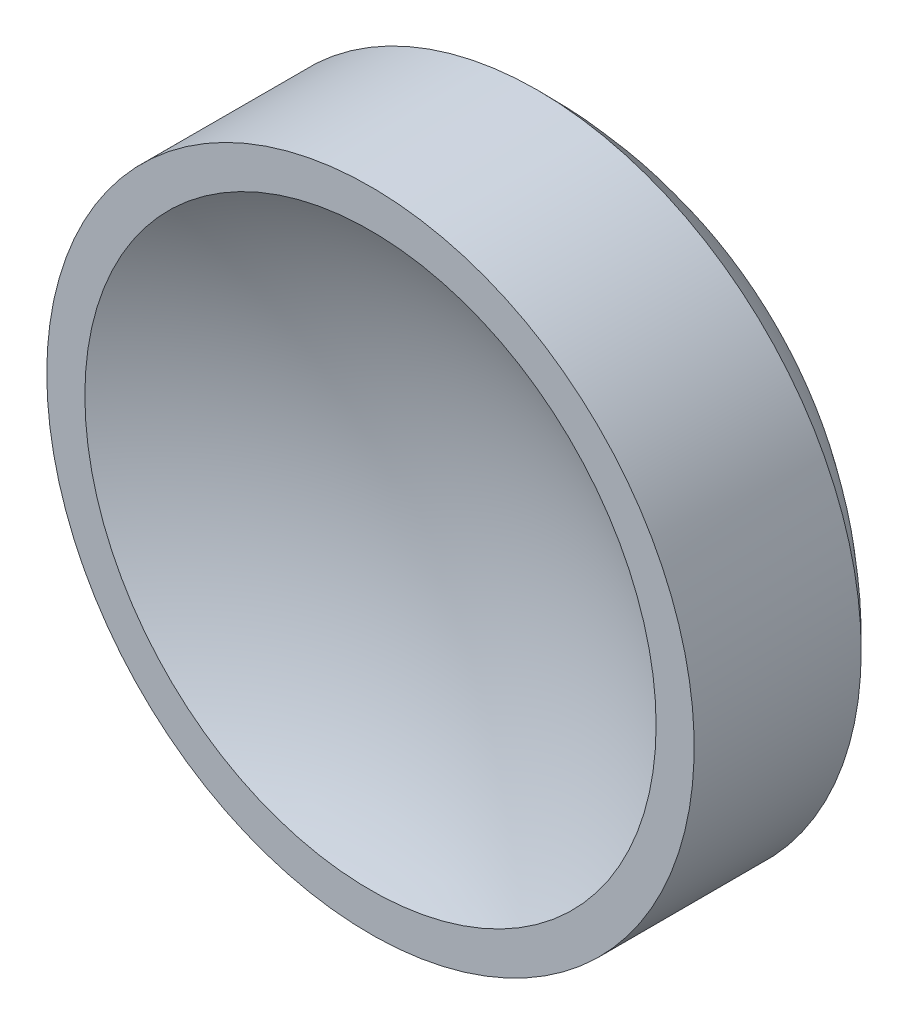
ISO-10303-21;
HEADER;
FILE_DESCRIPTION(('STEP AP214'),'2;1');
FILE_NAME('part.step','',(''),(''),'','','');
FILE_SCHEMA(('AUTOMOTIVE_DESIGN { 1 0 10303 214 1 1 1 1 }'));
ENDSEC;
DATA;
#1=APPLICATION_CONTEXT('core data for automotive mechanical design processes');
#2=APPLICATION_PROTOCOL_DEFINITION('international standard','automotive_design',2000,#1);
#3=PRODUCT_CONTEXT('',#1,'mechanical');
#4=PRODUCT('Part','Part','',(#3));
#5=PRODUCT_RELATED_PRODUCT_CATEGORY('part','',(#4));
#6=PRODUCT_DEFINITION_FORMATION('','',#4);
#7=PRODUCT_DEFINITION_CONTEXT('part definition',#1,'design');
#8=PRODUCT_DEFINITION('design','',#6,#7);
#9=PRODUCT_DEFINITION_SHAPE('','',#8);
#10=(LENGTH_UNIT() NAMED_UNIT(*) SI_UNIT(.MILLI.,.METRE.));
#11=(NAMED_UNIT(*) PLANE_ANGLE_UNIT() SI_UNIT($,.RADIAN.));
#12=(NAMED_UNIT(*) SI_UNIT($,.STERADIAN.) SOLID_ANGLE_UNIT());
#13=UNCERTAINTY_MEASURE_WITH_UNIT(LENGTH_MEASURE(1.E-05),#10,'distance_accuracy_value','');
#14=(GEOMETRIC_REPRESENTATION_CONTEXT(3) GLOBAL_UNCERTAINTY_ASSIGNED_CONTEXT((#13)) GLOBAL_UNIT_ASSIGNED_CONTEXT((#10,
#11,#12)) REPRESENTATION_CONTEXT('',''));
#15=CARTESIAN_POINT('',(0.,0.,0.));
#16=DIRECTION('',(0.,0.,1.));
#17=DIRECTION('',(1.,0.,0.));
#18=AXIS2_PLACEMENT_3D('',#15,#16,#17);
#19=CARTESIAN_POINT('',(0.,0.,5.1745));
#20=DIRECTION('',(0.,0.,-1.));
#21=DIRECTION('',(-1.,0.,0.));
#22=AXIS2_PLACEMENT_3D('',#19,#20,#21);
#23=CYLINDRICAL_SURFACE('',#22,8.5);
#24=CARTESIAN_POINT('',(0.,0.,0.490745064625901));
#25=DIRECTION('',(0.,0.,-1.));
#26=DIRECTION('',(-1.,0.,0.));
#27=AXIS2_PLACEMENT_3D('',#24,#25,#26);
#28=CIRCLE('',#27,8.5);
#29=CARTESIAN_POINT('',(-8.5,0.,0.490745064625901));
#30=VERTEX_POINT('',#29);
#31=EDGE_CURVE('E42',#30,#30,#28,.T.);
#32=ORIENTED_EDGE('',*,*,#31,.F.);
#33=EDGE_LOOP('',(#32));
#34=FACE_BOUND('',#33,.T.);
#35=CARTESIAN_POINT('',(0.,0.,4.876593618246));
#36=DIRECTION('',(0.,0.,-1.));
#37=DIRECTION('',(-1.,0.,0.));
#38=AXIS2_PLACEMENT_3D('',#35,#36,#37);
#39=CIRCLE('',#38,8.5);
#40=CARTESIAN_POINT('',(-8.5,0.,4.876593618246));
#41=VERTEX_POINT('',#40);
#42=EDGE_CURVE('E10',#41,#41,#39,.T.);
#43=ORIENTED_EDGE('',*,*,#42,.T.);
#44=EDGE_LOOP('',(#43));
#45=FACE_BOUND('',#44,.T.);
#46=ADVANCED_FACE('F32',(#34,#45),#23,.T.);
#47=CARTESIAN_POINT('',(-8.5,0.,4.876593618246));
#48=DIRECTION('',(0.,0.,-1.));
#49=DIRECTION('',(-1.,0.,0.));
#50=AXIS2_PLACEMENT_3D('',#47,#48,#49);
#51=PLANE('',#50);
#52=ORIENTED_EDGE('',*,*,#42,.F.);
#53=EDGE_LOOP('',(#52));
#54=FACE_BOUND('',#53,.T.);
#55=CARTESIAN_POINT('',(0.,0.,4.876593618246));
#56=DIRECTION('',(0.,0.,-1.));
#57=DIRECTION('',(-1.,0.,0.));
#58=AXIS2_PLACEMENT_3D('',#55,#56,#57);
#59=CIRCLE('',#58,7.5);
#60=CARTESIAN_POINT('',(-7.5,0.,4.876593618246));
#61=VERTEX_POINT('',#60);
#62=EDGE_CURVE('E38',#61,#61,#59,.T.);
#63=ORIENTED_EDGE('',*,*,#62,.T.);
#64=EDGE_LOOP('',(#63));
#65=FACE_BOUND('',#64,.T.);
#66=ADVANCED_FACE('F52',(#54,#65),#51,.F.);
#67=CARTESIAN_POINT('',(0.,0.,18.0329888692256));
#68=DIRECTION('',(0.,0.,1.));
#69=DIRECTION('',(1.,0.,0.));
#70=AXIS2_PLACEMENT_3D('',#67,#68,#69);
#71=SPHERICAL_SURFACE('',#70,15.144);
#72=ORIENTED_EDGE('',*,*,#62,.F.);
#73=EDGE_LOOP('',(#72));
#74=FACE_BOUND('',#73,.T.);
#75=ADVANCED_FACE('F56',(#74),#71,.F.);
#76=CARTESIAN_POINT('',(0.,0.,8.65095884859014));
#77=DIRECTION('',(0.,0.,1.));
#78=DIRECTION('',(1.,0.,0.));
#79=AXIS2_PLACEMENT_3D('',#76,#77,#78);
#80=SPHERICAL_SURFACE('',#79,11.783);
#81=ORIENTED_EDGE('',*,*,#31,.T.);
#82=EDGE_LOOP('',(#81));
#83=FACE_BOUND('',#82,.T.);
#84=ADVANCED_FACE('F49',(#83),#80,.T.);
#85=CLOSED_SHELL('',(#46,#66,#75,#84));
#86=MANIFOLD_SOLID_BREP('B2',#85);
#87=ADVANCED_BREP_SHAPE_REPRESENTATION('',(#18,#86),#14);
#88=SHAPE_DEFINITION_REPRESENTATION(#9,#87);
ENDSEC;
END-ISO-10303-21;
